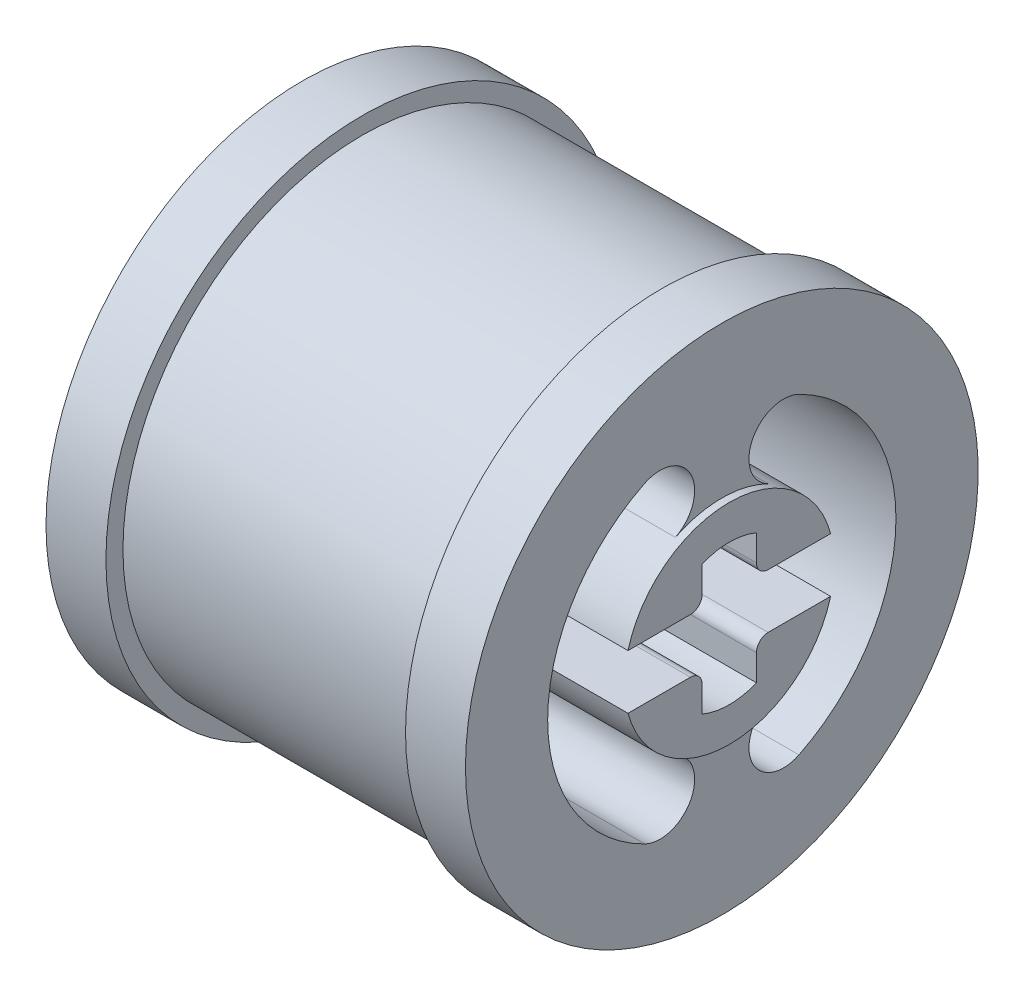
ISO-10303-21;
HEADER;
FILE_DESCRIPTION(('STEP AP214'),'2;1');
FILE_NAME('part.step','',(''),(''),'','','');
FILE_SCHEMA(('AUTOMOTIVE_DESIGN { 1 0 10303 214 1 1 1 1 }'));
ENDSEC;
DATA;
#1=APPLICATION_CONTEXT('core data for automotive mechanical design processes');
#2=APPLICATION_PROTOCOL_DEFINITION('international standard','automotive_design',2000,#1);
#3=PRODUCT_CONTEXT('',#1,'mechanical');
#4=PRODUCT('Part','Part','',(#3));
#5=PRODUCT_RELATED_PRODUCT_CATEGORY('part','',(#4));
#6=PRODUCT_DEFINITION_FORMATION('','',#4);
#7=PRODUCT_DEFINITION_CONTEXT('part definition',#1,'design');
#8=PRODUCT_DEFINITION('design','',#6,#7);
#9=PRODUCT_DEFINITION_SHAPE('','',#8);
#10=(LENGTH_UNIT() NAMED_UNIT(*) SI_UNIT(.MILLI.,.METRE.));
#11=(NAMED_UNIT(*) PLANE_ANGLE_UNIT() SI_UNIT($,.RADIAN.));
#12=(NAMED_UNIT(*) SI_UNIT($,.STERADIAN.) SOLID_ANGLE_UNIT());
#13=UNCERTAINTY_MEASURE_WITH_UNIT(LENGTH_MEASURE(1.E-05),#10,'distance_accuracy_value','');
#14=(GEOMETRIC_REPRESENTATION_CONTEXT(3) GLOBAL_UNCERTAINTY_ASSIGNED_CONTEXT((#13)) GLOBAL_UNIT_ASSIGNED_CONTEXT((#10,
#11,#12)) REPRESENTATION_CONTEXT('',''));
#15=CARTESIAN_POINT('',(0.,0.,0.));
#16=DIRECTION('',(0.,0.,1.));
#17=DIRECTION('',(1.,0.,0.));
#18=AXIS2_PLACEMENT_3D('',#15,#16,#17);
#19=CARTESIAN_POINT('',(7.366,0.,0.));
#20=DIRECTION('',(-1.,0.,0.));
#21=DIRECTION('',(0.,0.,1.));
#22=AXIS2_PLACEMENT_3D('',#19,#20,#21);
#23=CYLINDRICAL_SURFACE('',#22,3.556);
#24=CARTESIAN_POINT('',(-7.112,0.,0.));
#25=DIRECTION('',(-1.,0.,0.));
#26=DIRECTION('',(0.,0.,1.));
#27=AXIS2_PLACEMENT_3D('',#24,#25,#26);
#28=CIRCLE('',#27,3.556);
#29=CARTESIAN_POINT('',(-7.112,-3.18811339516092,1.57514093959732));
#30=VERTEX_POINT('',#29);
#31=CARTESIAN_POINT('',(-7.112,-3.18811339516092,-1.57514093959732));
#32=VERTEX_POINT('',#31);
#33=EDGE_CURVE('E277',#30,#32,#28,.F.);
#34=ORIENTED_EDGE('',*,*,#33,.F.);
#35=DIRECTION('',(1.,0.,0.));
#36=VECTOR('',#35,1.);
#37=CARTESIAN_POINT('',(0.,-3.18811339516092,1.57514093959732));
#38=LINE('',#37,#36);
#39=CARTESIAN_POINT('',(7.112,-3.18811339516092,1.57514093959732));
#40=VERTEX_POINT('',#39);
#41=EDGE_CURVE('E360',#30,#40,#38,.T.);
#42=ORIENTED_EDGE('',*,*,#41,.T.);
#43=CARTESIAN_POINT('',(7.112,0.,0.));
#44=DIRECTION('',(-1.,0.,0.));
#45=DIRECTION('',(0.,0.,1.));
#46=AXIS2_PLACEMENT_3D('',#43,#44,#45);
#47=CIRCLE('',#46,3.556);
#48=CARTESIAN_POINT('',(7.112,-3.18811339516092,-1.57514093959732));
#49=VERTEX_POINT('',#48);
#50=EDGE_CURVE('E377',#40,#49,#47,.F.);
#51=ORIENTED_EDGE('',*,*,#50,.T.);
#52=DIRECTION('',(1.,0.,0.));
#53=VECTOR('',#52,1.);
#54=CARTESIAN_POINT('',(0.,-3.18811339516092,-1.57514093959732));
#55=LINE('',#54,#53);
#56=EDGE_CURVE('E342',#32,#49,#55,.T.);
#57=ORIENTED_EDGE('',*,*,#56,.F.);
#58=EDGE_LOOP('',(#34,#42,#51,#57));
#59=FACE_BOUND('',#58,.T.);
#60=DIRECTION('',(1.,0.,0.));
#61=VECTOR('',#60,1.);
#62=CARTESIAN_POINT('',(0.,-0.92075,-3.43472785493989));
#63=LINE('',#62,#61);
#64=CARTESIAN_POINT('',(-7.366,-0.92075,-3.43472785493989));
#65=VERTEX_POINT('',#64);
#66=CARTESIAN_POINT('',(7.366,-0.92075,-3.43472785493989));
#67=VERTEX_POINT('',#66);
#68=EDGE_CURVE('E312',#65,#67,#63,.T.);
#69=ORIENTED_EDGE('',*,*,#68,.T.);
#70=CARTESIAN_POINT('',(7.366,0.,0.));
#71=DIRECTION('',(1.,0.,0.));
#72=DIRECTION('',(0.,0.,-1.));
#73=AXIS2_PLACEMENT_3D('',#70,#71,#72);
#74=CIRCLE('',#73,3.556);
#75=CARTESIAN_POINT('',(7.366,-0.920749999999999,3.43472785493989));
#76=VERTEX_POINT('',#75);
#77=EDGE_CURVE('E356',#76,#67,#74,.T.);
#78=ORIENTED_EDGE('',*,*,#77,.F.);
#79=DIRECTION('',(1.,0.,0.));
#80=VECTOR('',#79,1.);
#81=CARTESIAN_POINT('',(0.,-0.920749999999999,3.43472785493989));
#82=LINE('',#81,#80);
#83=CARTESIAN_POINT('',(-7.366,-0.920749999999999,3.43472785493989));
#84=VERTEX_POINT('',#83);
#85=EDGE_CURVE('E322',#84,#76,#82,.T.);
#86=ORIENTED_EDGE('',*,*,#85,.F.);
#87=CARTESIAN_POINT('',(-7.366,0.,0.));
#88=DIRECTION('',(1.,0.,0.));
#89=DIRECTION('',(0.,0.,-1.));
#90=AXIS2_PLACEMENT_3D('',#87,#88,#89);
#91=CIRCLE('',#90,3.556);
#92=EDGE_CURVE('E263',#84,#65,#91,.T.);
#93=ORIENTED_EDGE('',*,*,#92,.T.);
#94=EDGE_LOOP('',(#69,#78,#86,#93));
#95=FACE_BOUND('',#94,.T.);
#96=ADVANCED_FACE('F34',(#59,#95),#23,.T.);
#97=CARTESIAN_POINT('',(-7.366,0.92075,-3.43472785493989));
#98=VERTEX_POINT('',#97);
#99=CARTESIAN_POINT('',(-7.366,0.92075,3.43472785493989));
#100=VERTEX_POINT('',#99);
#101=EDGE_CURVE('E264',#98,#100,#91,.T.);
#102=ORIENTED_EDGE('',*,*,#101,.T.);
#103=DIRECTION('',(1.,0.,0.));
#104=VECTOR('',#103,1.);
#105=CARTESIAN_POINT('',(0.,0.92075,3.43472785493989));
#106=LINE('',#105,#104);
#107=CARTESIAN_POINT('',(7.366,0.92075,3.43472785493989));
#108=VERTEX_POINT('',#107);
#109=EDGE_CURVE('E324',#100,#108,#106,.T.);
#110=ORIENTED_EDGE('',*,*,#109,.T.);
#111=CARTESIAN_POINT('',(7.366,0.92075,-3.43472785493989));
#112=VERTEX_POINT('',#111);
#113=EDGE_CURVE('E364',#112,#108,#74,.T.);
#114=ORIENTED_EDGE('',*,*,#113,.F.);
#115=DIRECTION('',(1.,0.,0.));
#116=VECTOR('',#115,1.);
#117=CARTESIAN_POINT('',(0.,0.92075,-3.43472785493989));
#118=LINE('',#117,#116);
#119=EDGE_CURVE('E206',#98,#112,#118,.T.);
#120=ORIENTED_EDGE('',*,*,#119,.F.);
#121=EDGE_LOOP('',(#102,#110,#114,#120));
#122=FACE_BOUND('',#121,.T.);
#123=DIRECTION('',(1.,0.,0.));
#124=VECTOR('',#123,1.);
#125=CARTESIAN_POINT('',(0.,3.18811339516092,1.57514093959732));
#126=LINE('',#125,#124);
#127=CARTESIAN_POINT('',(-7.112,3.18811339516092,1.57514093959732));
#128=VERTEX_POINT('',#127);
#129=CARTESIAN_POINT('',(7.112,3.18811339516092,1.57514093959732));
#130=VERTEX_POINT('',#129);
#131=EDGE_CURVE('E357',#128,#130,#126,.T.);
#132=ORIENTED_EDGE('',*,*,#131,.F.);
#133=CARTESIAN_POINT('',(-7.112,3.18811339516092,-1.57514093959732));
#134=VERTEX_POINT('',#133);
#135=EDGE_CURVE('E276',#134,#128,#28,.F.);
#136=ORIENTED_EDGE('',*,*,#135,.F.);
#137=DIRECTION('',(1.,0.,0.));
#138=VECTOR('',#137,1.);
#139=CARTESIAN_POINT('',(0.,3.18811339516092,-1.57514093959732));
#140=LINE('',#139,#138);
#141=CARTESIAN_POINT('',(7.112,3.18811339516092,-1.57514093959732));
#142=VERTEX_POINT('',#141);
#143=EDGE_CURVE('E336',#134,#142,#140,.T.);
#144=ORIENTED_EDGE('',*,*,#143,.T.);
#145=EDGE_CURVE('E376',#142,#130,#47,.F.);
#146=ORIENTED_EDGE('',*,*,#145,.T.);
#147=EDGE_LOOP('',(#132,#136,#144,#146));
#148=FACE_BOUND('',#147,.T.);
#149=ADVANCED_FACE('F444',(#122,#148),#23,.T.);
#150=CARTESIAN_POINT('',(7.366,0.,0.));
#151=DIRECTION('',(1.,0.,0.));
#152=DIRECTION('',(0.,0.,-1.));
#153=AXIS2_PLACEMENT_3D('',#150,#151,#152);
#154=PLANE('',#153);
#155=DIRECTION('',(0.,-1.,0.));
#156=VECTOR('',#155,1.);
#157=CARTESIAN_POINT('',(7.366,-0.92075,0.92075));
#158=LINE('',#157,#156);
#159=CARTESIAN_POINT('',(7.366,-1.317625,0.92075));
#160=VERTEX_POINT('',#159);
#161=CARTESIAN_POINT('',(7.366,-2.20291924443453,0.92075));
#162=VERTEX_POINT('',#161);
#163=EDGE_CURVE('E303',#160,#162,#158,.T.);
#164=ORIENTED_EDGE('',*,*,#163,.F.);
#165=CARTESIAN_POINT('',(7.366,-1.317625,1.317625));
#166=DIRECTION('',(1.,0.,0.));
#167=DIRECTION('',(0.,0.,-1.));
#168=AXIS2_PLACEMENT_3D('',#165,#166,#167);
#169=CIRCLE('',#168,0.396875);
#170=CARTESIAN_POINT('',(7.366,-0.92075,1.317625));
#171=VERTEX_POINT('',#170);
#172=EDGE_CURVE('E49',#160,#171,#169,.T.);
#173=ORIENTED_EDGE('',*,*,#172,.T.);
#174=DIRECTION('',(0.,0.,-1.));
#175=VECTOR('',#174,1.);
#176=CARTESIAN_POINT('',(7.366,-0.92075,3.43472785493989));
#177=LINE('',#176,#175);
#178=EDGE_CURVE('E301',#76,#171,#177,.T.);
#179=ORIENTED_EDGE('',*,*,#178,.F.);
#180=ORIENTED_EDGE('',*,*,#77,.T.);
#181=DIRECTION('',(0.,0.,1.));
#182=VECTOR('',#181,1.);
#183=CARTESIAN_POINT('',(7.366,-0.92075,-3.43472785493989));
#184=LINE('',#183,#182);
#185=CARTESIAN_POINT('',(7.366,-0.92075,-1.317625));
#186=VERTEX_POINT('',#185);
#187=EDGE_CURVE('E310',#67,#186,#184,.T.);
#188=ORIENTED_EDGE('',*,*,#187,.T.);
#189=CARTESIAN_POINT('',(7.366,-1.317625,-1.317625));
#190=DIRECTION('',(1.,0.,0.));
#191=DIRECTION('',(0.,0.,-1.));
#192=AXIS2_PLACEMENT_3D('',#189,#190,#191);
#193=CIRCLE('',#192,0.396875);
#194=CARTESIAN_POINT('',(7.366,-1.317625,-0.92075));
#195=VERTEX_POINT('',#194);
#196=EDGE_CURVE('E56',#186,#195,#193,.T.);
#197=ORIENTED_EDGE('',*,*,#196,.T.);
#198=DIRECTION('',(0.,-1.,0.));
#199=VECTOR('',#198,1.);
#200=CARTESIAN_POINT('',(7.366,-0.92075,-0.92075));
#201=LINE('',#200,#199);
#202=CARTESIAN_POINT('',(7.366,-2.20291924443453,-0.92075));
#203=VERTEX_POINT('',#202);
#204=EDGE_CURVE('E308',#195,#203,#201,.T.);
#205=ORIENTED_EDGE('',*,*,#204,.T.);
#206=CARTESIAN_POINT('',(7.366,0.,0.));
#207=DIRECTION('',(-1.,0.,0.));
#208=DIRECTION('',(0.,0.,1.));
#209=AXIS2_PLACEMENT_3D('',#206,#207,#208);
#210=CIRCLE('',#209,2.3876);
#211=EDGE_CURVE('E305',#203,#162,#210,.T.);
#212=ORIENTED_EDGE('',*,*,#211,.T.);
#213=EDGE_LOOP('',(#164,#173,#179,#180,#188,#197,#205,#212));
#214=FACE_BOUND('',#213,.T.);
#215=ADVANCED_FACE('F406',(#214),#154,.T.);
#216=DIRECTION('',(0.,1.,0.));
#217=VECTOR('',#216,1.);
#218=CARTESIAN_POINT('',(7.366,0.92075,-0.92075));
#219=LINE('',#218,#217);
#220=CARTESIAN_POINT('',(7.366,1.317625,-0.92075));
#221=VERTEX_POINT('',#220);
#222=CARTESIAN_POINT('',(7.366,2.20291924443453,-0.92075));
#223=VERTEX_POINT('',#222);
#224=EDGE_CURVE('E201',#221,#223,#219,.T.);
#225=ORIENTED_EDGE('',*,*,#224,.F.);
#226=CARTESIAN_POINT('',(7.366,1.317625,-1.317625));
#227=DIRECTION('',(1.,0.,0.));
#228=DIRECTION('',(0.,0.,-1.));
#229=AXIS2_PLACEMENT_3D('',#226,#227,#228);
#230=CIRCLE('',#229,0.396875);
#231=CARTESIAN_POINT('',(7.366,0.92075,-1.317625));
#232=VERTEX_POINT('',#231);
#233=EDGE_CURVE('E384',#221,#232,#230,.T.);
#234=ORIENTED_EDGE('',*,*,#233,.T.);
#235=DIRECTION('',(0.,0.,1.));
#236=VECTOR('',#235,1.);
#237=CARTESIAN_POINT('',(7.366,0.92075,-3.43472785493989));
#238=LINE('',#237,#236);
#239=EDGE_CURVE('E290',#112,#232,#238,.T.);
#240=ORIENTED_EDGE('',*,*,#239,.F.);
#241=ORIENTED_EDGE('',*,*,#113,.T.);
#242=DIRECTION('',(0.,0.,-1.));
#243=VECTOR('',#242,1.);
#244=CARTESIAN_POINT('',(7.366,0.92075,3.43472785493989));
#245=LINE('',#244,#243);
#246=CARTESIAN_POINT('',(7.366,0.92075,1.317625));
#247=VERTEX_POINT('',#246);
#248=EDGE_CURVE('E298',#108,#247,#245,.T.);
#249=ORIENTED_EDGE('',*,*,#248,.T.);
#250=CARTESIAN_POINT('',(7.366,1.317625,1.317625));
#251=DIRECTION('',(1.,0.,0.));
#252=DIRECTION('',(0.,0.,-1.));
#253=AXIS2_PLACEMENT_3D('',#250,#251,#252);
#254=CIRCLE('',#253,0.396875);
#255=CARTESIAN_POINT('',(7.366,1.317625,0.92075));
#256=VERTEX_POINT('',#255);
#257=EDGE_CURVE('E382',#247,#256,#254,.T.);
#258=ORIENTED_EDGE('',*,*,#257,.T.);
#259=DIRECTION('',(0.,1.,0.));
#260=VECTOR('',#259,1.);
#261=CARTESIAN_POINT('',(7.366,0.92075,0.92075));
#262=LINE('',#261,#260);
#263=CARTESIAN_POINT('',(7.366,2.20291924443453,0.92075));
#264=VERTEX_POINT('',#263);
#265=EDGE_CURVE('E296',#256,#264,#262,.T.);
#266=ORIENTED_EDGE('',*,*,#265,.T.);
#267=CARTESIAN_POINT('',(7.366,0.,0.));
#268=DIRECTION('',(1.,0.,0.));
#269=DIRECTION('',(0.,0.,-1.));
#270=AXIS2_PLACEMENT_3D('',#267,#268,#269);
#271=CIRCLE('',#270,2.3876);
#272=EDGE_CURVE('E294',#223,#264,#271,.T.);
#273=ORIENTED_EDGE('',*,*,#272,.F.);
#274=EDGE_LOOP('',(#225,#234,#240,#241,#249,#258,#266,#273));
#275=FACE_BOUND('',#274,.T.);
#276=ADVANCED_FACE('F470',(#275),#154,.T.);
#277=CARTESIAN_POINT('',(7.112,0.,0.));
#278=DIRECTION('',(-1.,0.,0.));
#279=DIRECTION('',(0.,0.,1.));
#280=AXIS2_PLACEMENT_3D('',#277,#278,#279);
#281=PLANE('',#280);
#282=CARTESIAN_POINT('',(7.112,0.,0.));
#283=DIRECTION('',(-1.,0.,0.));
#284=DIRECTION('',(0.,0.,1.));
#285=AXIS2_PLACEMENT_3D('',#282,#283,#284);
#286=CIRCLE('',#285,8.69315);
#287=CARTESIAN_POINT('',(7.112,0.,8.69315));
#288=VERTEX_POINT('',#287);
#289=EDGE_CURVE('E373',#288,#288,#286,.T.);
#290=ORIENTED_EDGE('',*,*,#289,.F.);
#291=EDGE_LOOP('',(#290));
#292=FACE_BOUND('',#291,.T.);
#293=ORIENTED_EDGE('',*,*,#145,.F.);
#294=CARTESIAN_POINT('',(7.112,4.24132942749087,-2.0955));
#295=DIRECTION('',(1.,0.,0.));
#296=DIRECTION('',(0.,0.,-1.));
#297=AXIS2_PLACEMENT_3D('',#294,#295,#296);
#298=CIRCLE('',#297,1.17475);
#299=CARTESIAN_POINT('',(7.112,5.29454545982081,-2.61585906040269));
#300=VERTEX_POINT('',#299);
#301=EDGE_CURVE('E315',#300,#142,#298,.T.);
#302=ORIENTED_EDGE('',*,*,#301,.F.);
#303=CARTESIAN_POINT('',(7.112,0.,0.));
#304=DIRECTION('',(1.,0.,0.));
#305=DIRECTION('',(0.,0.,-1.));
#306=AXIS2_PLACEMENT_3D('',#303,#304,#305);
#307=CIRCLE('',#306,5.9055);
#308=CARTESIAN_POINT('',(7.112,-5.29454545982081,-2.61585906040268));
#309=VERTEX_POINT('',#308);
#310=EDGE_CURVE('E333',#309,#300,#307,.T.);
#311=ORIENTED_EDGE('',*,*,#310,.F.);
#312=CARTESIAN_POINT('',(7.112,-4.24132942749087,-2.0955));
#313=DIRECTION('',(-1.,0.,0.));
#314=DIRECTION('',(0.,0.,1.));
#315=AXIS2_PLACEMENT_3D('',#312,#313,#314);
#316=CIRCLE('',#315,1.17475);
#317=EDGE_CURVE('E330',#309,#49,#316,.T.);
#318=ORIENTED_EDGE('',*,*,#317,.T.);
#319=ORIENTED_EDGE('',*,*,#50,.F.);
#320=CARTESIAN_POINT('',(7.112,-4.24132942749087,2.0955));
#321=DIRECTION('',(1.,0.,0.));
#322=DIRECTION('',(0.,0.,-1.));
#323=AXIS2_PLACEMENT_3D('',#320,#321,#322);
#324=CIRCLE('',#323,1.17475);
#325=CARTESIAN_POINT('',(7.112,-5.29454545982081,2.61585906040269));
#326=VERTEX_POINT('',#325);
#327=EDGE_CURVE('E348',#326,#40,#324,.T.);
#328=ORIENTED_EDGE('',*,*,#327,.F.);
#329=CARTESIAN_POINT('',(7.112,0.,0.));
#330=DIRECTION('',(1.,0.,0.));
#331=DIRECTION('',(0.,0.,-1.));
#332=AXIS2_PLACEMENT_3D('',#329,#330,#331);
#333=CIRCLE('',#332,5.9055);
#334=CARTESIAN_POINT('',(7.112,5.29454545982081,2.61585906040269));
#335=VERTEX_POINT('',#334);
#336=EDGE_CURVE('E339',#335,#326,#333,.T.);
#337=ORIENTED_EDGE('',*,*,#336,.F.);
#338=CARTESIAN_POINT('',(7.112,4.24132942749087,2.0955));
#339=DIRECTION('',(-1.,0.,0.));
#340=DIRECTION('',(0.,0.,1.));
#341=AXIS2_PLACEMENT_3D('',#338,#339,#340);
#342=CIRCLE('',#341,1.17475);
#343=EDGE_CURVE('E350',#335,#130,#342,.T.);
#344=ORIENTED_EDGE('',*,*,#343,.T.);
#345=EDGE_LOOP('',(#293,#302,#311,#318,#319,#328,#337,#344));
#346=FACE_BOUND('',#345,.T.);
#347=ADVANCED_FACE('F467',(#292,#346),#281,.F.);
#348=CARTESIAN_POINT('',(0.,0.,0.));
#349=DIRECTION('',(-1.,0.,0.));
#350=DIRECTION('',(0.,0.,1.));
#351=AXIS2_PLACEMENT_3D('',#348,#349,#350);
#352=CYLINDRICAL_SURFACE('',#351,8.69315);
#353=ORIENTED_EDGE('',*,*,#289,.T.);
#354=EDGE_LOOP('',(#353));
#355=FACE_BOUND('',#354,.T.);
#356=CARTESIAN_POINT('',(5.08,0.,0.));
#357=DIRECTION('',(-1.,0.,0.));
#358=DIRECTION('',(0.,0.,1.));
#359=AXIS2_PLACEMENT_3D('',#356,#357,#358);
#360=CIRCLE('',#359,8.69315);
#361=CARTESIAN_POINT('',(5.08,0.,8.69315));
#362=VERTEX_POINT('',#361);
#363=EDGE_CURVE('E370',#362,#362,#360,.T.);
#364=ORIENTED_EDGE('',*,*,#363,.F.);
#365=EDGE_LOOP('',(#364));
#366=FACE_BOUND('',#365,.T.);
#367=ADVANCED_FACE('F463',(#355,#366),#352,.T.);
#368=CARTESIAN_POINT('',(5.08,8.1153,0.));
#369=DIRECTION('',(-1.,0.,0.));
#370=DIRECTION('',(0.,0.,1.));
#371=AXIS2_PLACEMENT_3D('',#368,#369,#370);
#372=PLANE('',#371);
#373=ORIENTED_EDGE('',*,*,#363,.T.);
#374=EDGE_LOOP('',(#373));
#375=FACE_BOUND('',#374,.T.);
#376=CARTESIAN_POINT('',(5.08,0.,0.));
#377=DIRECTION('',(-1.,0.,0.));
#378=DIRECTION('',(0.,0.,1.));
#379=AXIS2_PLACEMENT_3D('',#376,#377,#378);
#380=CIRCLE('',#379,8.1153);
#381=CARTESIAN_POINT('',(5.08,0.,8.1153));
#382=VERTEX_POINT('',#381);
#383=EDGE_CURVE('E367',#382,#382,#380,.T.);
#384=ORIENTED_EDGE('',*,*,#383,.F.);
#385=EDGE_LOOP('',(#384));
#386=FACE_BOUND('',#385,.T.);
#387=ADVANCED_FACE('F459',(#375,#386),#372,.T.);
#388=CARTESIAN_POINT('',(0.,0.,0.));
#389=DIRECTION('',(-1.,0.,0.));
#390=DIRECTION('',(0.,0.,1.));
#391=AXIS2_PLACEMENT_3D('',#388,#389,#390);
#392=CYLINDRICAL_SURFACE('',#391,8.1153);
#393=ORIENTED_EDGE('',*,*,#383,.T.);
#394=EDGE_LOOP('',(#393));
#395=FACE_BOUND('',#394,.T.);
#396=CARTESIAN_POINT('',(-5.08,0.,0.));
#397=DIRECTION('',(-1.,0.,0.));
#398=DIRECTION('',(0.,0.,1.));
#399=AXIS2_PLACEMENT_3D('',#396,#397,#398);
#400=CIRCLE('',#399,8.1153);
#401=CARTESIAN_POINT('',(-5.08,0.,8.1153));
#402=VERTEX_POINT('',#401);
#403=EDGE_CURVE('E267',#402,#402,#400,.T.);
#404=ORIENTED_EDGE('',*,*,#403,.F.);
#405=EDGE_LOOP('',(#404));
#406=FACE_BOUND('',#405,.T.);
#407=ADVANCED_FACE('F455',(#395,#406),#392,.T.);
#408=CARTESIAN_POINT('',(0.,0.,0.));
#409=DIRECTION('',(1.,0.,0.));
#410=DIRECTION('',(0.,0.,-1.));
#411=AXIS2_PLACEMENT_3D('',#408,#409,#410);
#412=CYLINDRICAL_SURFACE('',#411,5.9055);
#413=ORIENTED_EDGE('',*,*,#336,.T.);
#414=DIRECTION('',(1.,0.,0.));
#415=VECTOR('',#414,1.);
#416=CARTESIAN_POINT('',(0.,-5.29454545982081,2.61585906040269));
#417=LINE('',#416,#415);
#418=CARTESIAN_POINT('',(-7.112,-5.29454545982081,2.61585906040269));
#419=VERTEX_POINT('',#418);
#420=EDGE_CURVE('E353',#419,#326,#417,.T.);
#421=ORIENTED_EDGE('',*,*,#420,.F.);
#422=CARTESIAN_POINT('',(-7.112,0.,0.));
#423=DIRECTION('',(1.,0.,0.));
#424=DIRECTION('',(0.,0.,-1.));
#425=AXIS2_PLACEMENT_3D('',#422,#423,#424);
#426=CIRCLE('',#425,5.9055);
#427=CARTESIAN_POINT('',(-7.112,5.29454545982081,2.61585906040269));
#428=VERTEX_POINT('',#427);
#429=EDGE_CURVE('E254',#428,#419,#426,.T.);
#430=ORIENTED_EDGE('',*,*,#429,.F.);
#431=DIRECTION('',(1.,0.,0.));
#432=VECTOR('',#431,1.);
#433=CARTESIAN_POINT('',(0.,5.29454545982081,2.61585906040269));
#434=LINE('',#433,#432);
#435=EDGE_CURVE('E354',#428,#335,#434,.T.);
#436=ORIENTED_EDGE('',*,*,#435,.T.);
#437=EDGE_LOOP('',(#413,#421,#430,#436));
#438=FACE_BOUND('',#437,.T.);
#439=ADVANCED_FACE('F458',(#438),#412,.F.);
#440=CARTESIAN_POINT('',(0.,4.24132942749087,2.0955));
#441=DIRECTION('',(1.,0.,0.));
#442=DIRECTION('',(0.,0.,-1.));
#443=AXIS2_PLACEMENT_3D('',#440,#441,#442);
#444=CYLINDRICAL_SURFACE('',#443,1.17475);
#445=ORIENTED_EDGE('',*,*,#343,.F.);
#446=ORIENTED_EDGE('',*,*,#435,.F.);
#447=CARTESIAN_POINT('',(-7.112,4.24132942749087,2.0955));
#448=DIRECTION('',(-1.,0.,0.));
#449=DIRECTION('',(0.,0.,1.));
#450=AXIS2_PLACEMENT_3D('',#447,#448,#449);
#451=CIRCLE('',#450,1.17475);
#452=EDGE_CURVE('E260',#428,#128,#451,.T.);
#453=ORIENTED_EDGE('',*,*,#452,.T.);
#454=ORIENTED_EDGE('',*,*,#131,.T.);
#455=EDGE_LOOP('',(#445,#446,#453,#454));
#456=FACE_BOUND('',#455,.T.);
#457=ADVANCED_FACE('F705',(#456),#444,.F.);
#458=CARTESIAN_POINT('',(0.,-4.24132942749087,2.0955));
#459=DIRECTION('',(1.,0.,0.));
#460=DIRECTION('',(0.,0.,-1.));
#461=AXIS2_PLACEMENT_3D('',#458,#459,#460);
#462=CYLINDRICAL_SURFACE('',#461,1.17475);
#463=ORIENTED_EDGE('',*,*,#327,.T.);
#464=ORIENTED_EDGE('',*,*,#41,.F.);
#465=CARTESIAN_POINT('',(-7.112,-4.24132942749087,2.0955));
#466=DIRECTION('',(1.,0.,0.));
#467=DIRECTION('',(0.,0.,-1.));
#468=AXIS2_PLACEMENT_3D('',#465,#466,#467);
#469=CIRCLE('',#468,1.17475);
#470=EDGE_CURVE('E257',#419,#30,#469,.T.);
#471=ORIENTED_EDGE('',*,*,#470,.F.);
#472=ORIENTED_EDGE('',*,*,#420,.T.);
#473=EDGE_LOOP('',(#463,#464,#471,#472));
#474=FACE_BOUND('',#473,.T.);
#475=ADVANCED_FACE('F694',(#474),#462,.F.);
#476=CARTESIAN_POINT('',(0.,4.24132942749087,-2.0955));
#477=DIRECTION('',(1.,0.,0.));
#478=DIRECTION('',(0.,0.,-1.));
#479=AXIS2_PLACEMENT_3D('',#476,#477,#478);
#480=CYLINDRICAL_SURFACE('',#479,1.17475);
#481=ORIENTED_EDGE('',*,*,#301,.T.);
#482=ORIENTED_EDGE('',*,*,#143,.F.);
#483=CARTESIAN_POINT('',(-7.112,4.24132942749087,-2.0955));
#484=DIRECTION('',(1.,0.,0.));
#485=DIRECTION('',(0.,0.,-1.));
#486=AXIS2_PLACEMENT_3D('',#483,#484,#485);
#487=CIRCLE('',#486,1.17475);
#488=CARTESIAN_POINT('',(-7.112,5.29454545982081,-2.61585906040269));
#489=VERTEX_POINT('',#488);
#490=EDGE_CURVE('E245',#489,#134,#487,.T.);
#491=ORIENTED_EDGE('',*,*,#490,.F.);
#492=DIRECTION('',(1.,0.,0.));
#493=VECTOR('',#492,1.);
#494=CARTESIAN_POINT('',(0.,5.29454545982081,-2.61585906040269));
#495=LINE('',#494,#493);
#496=EDGE_CURVE('E337',#489,#300,#495,.T.);
#497=ORIENTED_EDGE('',*,*,#496,.T.);
#498=EDGE_LOOP('',(#481,#482,#491,#497));
#499=FACE_BOUND('',#498,.T.);
#500=ADVANCED_FACE('F683',(#499),#480,.F.);
#501=CARTESIAN_POINT('',(0.,0.,0.));
#502=DIRECTION('',(1.,0.,0.));
#503=DIRECTION('',(0.,0.,-1.));
#504=AXIS2_PLACEMENT_3D('',#501,#502,#503);
#505=CYLINDRICAL_SURFACE('',#504,5.9055);
#506=ORIENTED_EDGE('',*,*,#310,.T.);
#507=ORIENTED_EDGE('',*,*,#496,.F.);
#508=CARTESIAN_POINT('',(-7.112,0.,0.));
#509=DIRECTION('',(1.,0.,0.));
#510=DIRECTION('',(0.,0.,-1.));
#511=AXIS2_PLACEMENT_3D('',#508,#509,#510);
#512=CIRCLE('',#511,5.9055);
#513=CARTESIAN_POINT('',(-7.112,-5.29454545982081,-2.61585906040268));
#514=VERTEX_POINT('',#513);
#515=EDGE_CURVE('E251',#514,#489,#512,.T.);
#516=ORIENTED_EDGE('',*,*,#515,.F.);
#517=DIRECTION('',(1.,0.,0.));
#518=VECTOR('',#517,1.);
#519=CARTESIAN_POINT('',(0.,-5.29454545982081,-2.61585906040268));
#520=LINE('',#519,#518);
#521=EDGE_CURVE('E340',#514,#309,#520,.T.);
#522=ORIENTED_EDGE('',*,*,#521,.T.);
#523=EDGE_LOOP('',(#506,#507,#516,#522));
#524=FACE_BOUND('',#523,.T.);
#525=ADVANCED_FACE('F672',(#524),#505,.F.);
#526=CARTESIAN_POINT('',(0.,-4.24132942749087,-2.0955));
#527=DIRECTION('',(1.,0.,0.));
#528=DIRECTION('',(0.,0.,-1.));
#529=AXIS2_PLACEMENT_3D('',#526,#527,#528);
#530=CYLINDRICAL_SURFACE('',#529,1.17475);
#531=ORIENTED_EDGE('',*,*,#317,.F.);
#532=ORIENTED_EDGE('',*,*,#521,.F.);
#533=CARTESIAN_POINT('',(-7.112,-4.24132942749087,-2.0955));
#534=DIRECTION('',(-1.,0.,0.));
#535=DIRECTION('',(0.,0.,1.));
#536=AXIS2_PLACEMENT_3D('',#533,#534,#535);
#537=CIRCLE('',#536,1.17475);
#538=EDGE_CURVE('E248',#514,#32,#537,.T.);
#539=ORIENTED_EDGE('',*,*,#538,.T.);
#540=ORIENTED_EDGE('',*,*,#56,.T.);
#541=EDGE_LOOP('',(#531,#532,#539,#540));
#542=FACE_BOUND('',#541,.T.);
#543=ADVANCED_FACE('F623',(#542),#530,.F.);
#544=CARTESIAN_POINT('',(0.,0.92075,-3.43472785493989));
#545=DIRECTION('',(0.,1.,0.));
#546=DIRECTION('',(0.,0.,1.));
#547=AXIS2_PLACEMENT_3D('',#544,#545,#546);
#548=PLANE('',#547);
#549=ORIENTED_EDGE('',*,*,#239,.T.);
#550=DIRECTION('',(1.,0.,0.));
#551=VECTOR('',#550,1.);
#552=CARTESIAN_POINT('',(0.,0.92075,-1.317625));
#553=LINE('',#552,#551);
#554=CARTESIAN_POINT('',(-7.366,0.92075,-1.317625));
#555=VERTEX_POINT('',#554);
#556=EDGE_CURVE('E386',#232,#555,#553,.F.);
#557=ORIENTED_EDGE('',*,*,#556,.T.);
#558=DIRECTION('',(0.,0.,1.));
#559=VECTOR('',#558,1.);
#560=CARTESIAN_POINT('',(-7.366,0.92075,-3.43472785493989));
#561=LINE('',#560,#559);
#562=EDGE_CURVE('E222',#98,#555,#561,.T.);
#563=ORIENTED_EDGE('',*,*,#562,.F.);
#564=ORIENTED_EDGE('',*,*,#119,.T.);
#565=EDGE_LOOP('',(#549,#557,#563,#564));
#566=FACE_BOUND('',#565,.T.);
#567=ADVANCED_FACE('F613',(#566),#548,.F.);
#568=CARTESIAN_POINT('',(0.,0.92075,-0.92075));
#569=DIRECTION('',(0.,0.,-1.));
#570=DIRECTION('',(-1.,0.,0.));
#571=AXIS2_PLACEMENT_3D('',#568,#569,#570);
#572=PLANE('',#571);
#573=DIRECTION('',(1.,0.,0.));
#574=VECTOR('',#573,1.);
#575=CARTESIAN_POINT('',(0.,2.20291924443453,-0.92075));
#576=LINE('',#575,#574);
#577=CARTESIAN_POINT('',(-7.366,2.20291924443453,-0.92075));
#578=VERTEX_POINT('',#577);
#579=EDGE_CURVE('E194',#578,#223,#576,.T.);
#580=ORIENTED_EDGE('',*,*,#579,.F.);
#581=DIRECTION('',(0.,1.,0.));
#582=VECTOR('',#581,1.);
#583=CARTESIAN_POINT('',(-7.366,0.92075,-0.92075));
#584=LINE('',#583,#582);
#585=CARTESIAN_POINT('',(-7.366,1.317625,-0.92075));
#586=VERTEX_POINT('',#585);
#587=EDGE_CURVE('E199',#586,#578,#584,.T.);
#588=ORIENTED_EDGE('',*,*,#587,.F.);
#589=DIRECTION('',(1.,0.,0.));
#590=VECTOR('',#589,1.);
#591=CARTESIAN_POINT('',(0.,1.317625,-0.92075));
#592=LINE('',#591,#590);
#593=EDGE_CURVE('E380',#586,#221,#592,.T.);
#594=ORIENTED_EDGE('',*,*,#593,.T.);
#595=ORIENTED_EDGE('',*,*,#224,.T.);
#596=EDGE_LOOP('',(#580,#588,#594,#595));
#597=FACE_BOUND('',#596,.T.);
#598=ADVANCED_FACE('F196',(#597),#572,.F.);
#599=CARTESIAN_POINT('',(0.,0.,0.));
#600=DIRECTION('',(1.,0.,0.));
#601=DIRECTION('',(0.,0.,-1.));
#602=AXIS2_PLACEMENT_3D('',#599,#600,#601);
#603=CYLINDRICAL_SURFACE('',#602,2.3876);
#604=ORIENTED_EDGE('',*,*,#272,.T.);
#605=DIRECTION('',(1.,0.,0.));
#606=VECTOR('',#605,1.);
#607=CARTESIAN_POINT('',(0.,2.20291924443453,0.92075));
#608=LINE('',#607,#606);
#609=CARTESIAN_POINT('',(-7.366,2.20291924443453,0.92075));
#610=VERTEX_POINT('',#609);
#611=EDGE_CURVE('E205',#610,#264,#608,.T.);
#612=ORIENTED_EDGE('',*,*,#611,.F.);
#613=CARTESIAN_POINT('',(-7.366,0.,0.));
#614=DIRECTION('',(1.,0.,0.));
#615=DIRECTION('',(0.,0.,-1.));
#616=AXIS2_PLACEMENT_3D('',#613,#614,#615);
#617=CIRCLE('',#616,2.3876);
#618=EDGE_CURVE('E209',#578,#610,#617,.T.);
#619=ORIENTED_EDGE('',*,*,#618,.F.);
#620=ORIENTED_EDGE('',*,*,#579,.T.);
#621=EDGE_LOOP('',(#604,#612,#619,#620));
#622=FACE_BOUND('',#621,.T.);
#623=ADVANCED_FACE('F210',(#622),#603,.F.);
#624=CARTESIAN_POINT('',(0.,0.92075,0.92075));
#625=DIRECTION('',(0.,0.,-1.));
#626=DIRECTION('',(-1.,0.,0.));
#627=AXIS2_PLACEMENT_3D('',#624,#625,#626);
#628=PLANE('',#627);
#629=ORIENTED_EDGE('',*,*,#265,.F.);
#630=DIRECTION('',(1.,0.,0.));
#631=VECTOR('',#630,1.);
#632=CARTESIAN_POINT('',(0.,1.317625,0.92075));
#633=LINE('',#632,#631);
#634=CARTESIAN_POINT('',(-7.366,1.317625,0.92075));
#635=VERTEX_POINT('',#634);
#636=EDGE_CURVE('E391',#256,#635,#633,.F.);
#637=ORIENTED_EDGE('',*,*,#636,.T.);
#638=DIRECTION('',(0.,1.,0.));
#639=VECTOR('',#638,1.);
#640=CARTESIAN_POINT('',(-7.366,0.92075,0.92075));
#641=LINE('',#640,#639);
#642=EDGE_CURVE('E215',#635,#610,#641,.T.);
#643=ORIENTED_EDGE('',*,*,#642,.T.);
#644=ORIENTED_EDGE('',*,*,#611,.T.);
#645=EDGE_LOOP('',(#629,#637,#643,#644));
#646=FACE_BOUND('',#645,.T.);
#647=ADVANCED_FACE('F591',(#646),#628,.T.);
#648=CARTESIAN_POINT('',(0.,0.92075,3.43472785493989));
#649=DIRECTION('',(0.,-1.,0.));
#650=DIRECTION('',(0.,0.,-1.));
#651=AXIS2_PLACEMENT_3D('',#648,#649,#650);
#652=PLANE('',#651);
#653=ORIENTED_EDGE('',*,*,#109,.F.);
#654=DIRECTION('',(0.,0.,-1.));
#655=VECTOR('',#654,1.);
#656=CARTESIAN_POINT('',(-7.366,0.92075,3.43472785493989));
#657=LINE('',#656,#655);
#658=CARTESIAN_POINT('',(-7.366,0.92075,1.317625));
#659=VERTEX_POINT('',#658);
#660=EDGE_CURVE('E227',#100,#659,#657,.T.);
#661=ORIENTED_EDGE('',*,*,#660,.T.);
#662=DIRECTION('',(1.,0.,0.));
#663=VECTOR('',#662,1.);
#664=CARTESIAN_POINT('',(0.,0.92075,1.317625));
#665=LINE('',#664,#663);
#666=EDGE_CURVE('E388',#659,#247,#665,.T.);
#667=ORIENTED_EDGE('',*,*,#666,.T.);
#668=ORIENTED_EDGE('',*,*,#248,.F.);
#669=EDGE_LOOP('',(#653,#661,#667,#668));
#670=FACE_BOUND('',#669,.T.);
#671=ADVANCED_FACE('F501',(#670),#652,.T.);
#672=CARTESIAN_POINT('',(0.,-0.92075,-3.43472785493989));
#673=DIRECTION('',(0.,1.,0.));
#674=DIRECTION('',(0.,0.,1.));
#675=AXIS2_PLACEMENT_3D('',#672,#673,#674);
#676=PLANE('',#675);
#677=ORIENTED_EDGE('',*,*,#68,.F.);
#678=DIRECTION('',(0.,0.,1.));
#679=VECTOR('',#678,1.);
#680=CARTESIAN_POINT('',(-7.366,-0.92075,-3.43472785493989));
#681=LINE('',#680,#679);
#682=CARTESIAN_POINT('',(-7.366,-0.92075,-1.317625));
#683=VERTEX_POINT('',#682);
#684=EDGE_CURVE('E242',#65,#683,#681,.T.);
#685=ORIENTED_EDGE('',*,*,#684,.T.);
#686=DIRECTION('',(1.,0.,0.));
#687=VECTOR('',#686,1.);
#688=CARTESIAN_POINT('',(0.,-0.92075,-1.317625));
#689=LINE('',#688,#687);
#690=EDGE_CURVE('E42',#683,#186,#689,.T.);
#691=ORIENTED_EDGE('',*,*,#690,.T.);
#692=ORIENTED_EDGE('',*,*,#187,.F.);
#693=EDGE_LOOP('',(#677,#685,#691,#692));
#694=FACE_BOUND('',#693,.T.);
#695=ADVANCED_FACE('F401',(#694),#676,.T.);
#696=CARTESIAN_POINT('',(0.,-0.92075,-0.92075));
#697=DIRECTION('',(0.,0.,1.));
#698=DIRECTION('',(1.,0.,0.));
#699=AXIS2_PLACEMENT_3D('',#696,#697,#698);
#700=PLANE('',#699);
#701=ORIENTED_EDGE('',*,*,#204,.F.);
#702=DIRECTION('',(1.,0.,0.));
#703=VECTOR('',#702,1.);
#704=CARTESIAN_POINT('',(0.,-1.317625,-0.92075));
#705=LINE('',#704,#703);
#706=CARTESIAN_POINT('',(-7.366,-1.317625,-0.92075));
#707=VERTEX_POINT('',#706);
#708=EDGE_CURVE('E11',#195,#707,#705,.F.);
#709=ORIENTED_EDGE('',*,*,#708,.T.);
#710=DIRECTION('',(0.,-1.,0.));
#711=VECTOR('',#710,1.);
#712=CARTESIAN_POINT('',(-7.366,-0.92075,-0.92075));
#713=LINE('',#712,#711);
#714=CARTESIAN_POINT('',(-7.366,-2.20291924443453,-0.92075));
#715=VERTEX_POINT('',#714);
#716=EDGE_CURVE('E239',#707,#715,#713,.T.);
#717=ORIENTED_EDGE('',*,*,#716,.T.);
#718=DIRECTION('',(1.,0.,0.));
#719=VECTOR('',#718,1.);
#720=CARTESIAN_POINT('',(0.,-2.20291924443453,-0.92075));
#721=LINE('',#720,#719);
#722=EDGE_CURVE('E316',#715,#203,#721,.T.);
#723=ORIENTED_EDGE('',*,*,#722,.T.);
#724=EDGE_LOOP('',(#701,#709,#717,#723));
#725=FACE_BOUND('',#724,.T.);
#726=ADVANCED_FACE('F418',(#725),#700,.T.);
#727=CARTESIAN_POINT('',(0.,0.,0.));
#728=DIRECTION('',(1.,0.,0.));
#729=DIRECTION('',(0.,0.,-1.));
#730=AXIS2_PLACEMENT_3D('',#727,#728,#729);
#731=CYLINDRICAL_SURFACE('',#730,2.3876);
#732=ORIENTED_EDGE('',*,*,#211,.F.);
#733=ORIENTED_EDGE('',*,*,#722,.F.);
#734=CARTESIAN_POINT('',(-7.366,0.,0.));
#735=DIRECTION('',(-1.,0.,0.));
#736=DIRECTION('',(0.,0.,1.));
#737=AXIS2_PLACEMENT_3D('',#734,#735,#736);
#738=CIRCLE('',#737,2.3876);
#739=CARTESIAN_POINT('',(-7.366,-2.20291924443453,0.92075));
#740=VERTEX_POINT('',#739);
#741=EDGE_CURVE('E236',#715,#740,#738,.T.);
#742=ORIENTED_EDGE('',*,*,#741,.T.);
#743=DIRECTION('',(1.,0.,0.));
#744=VECTOR('',#743,1.);
#745=CARTESIAN_POINT('',(0.,-2.20291924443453,0.92075));
#746=LINE('',#745,#744);
#747=EDGE_CURVE('E319',#740,#162,#746,.T.);
#748=ORIENTED_EDGE('',*,*,#747,.T.);
#749=EDGE_LOOP('',(#732,#733,#742,#748));
#750=FACE_BOUND('',#749,.T.);
#751=ADVANCED_FACE('F421',(#750),#731,.F.);
#752=CARTESIAN_POINT('',(0.,-0.92075,0.92075));
#753=DIRECTION('',(0.,0.,1.));
#754=DIRECTION('',(1.,0.,0.));
#755=AXIS2_PLACEMENT_3D('',#752,#753,#754);
#756=PLANE('',#755);
#757=ORIENTED_EDGE('',*,*,#747,.F.);
#758=DIRECTION('',(0.,-1.,0.));
#759=VECTOR('',#758,1.);
#760=CARTESIAN_POINT('',(-7.366,-0.92075,0.92075));
#761=LINE('',#760,#759);
#762=CARTESIAN_POINT('',(-7.366,-1.317625,0.92075));
#763=VERTEX_POINT('',#762);
#764=EDGE_CURVE('E233',#763,#740,#761,.T.);
#765=ORIENTED_EDGE('',*,*,#764,.F.);
#766=DIRECTION('',(1.,0.,0.));
#767=VECTOR('',#766,1.);
#768=CARTESIAN_POINT('',(0.,-1.317625,0.92075));
#769=LINE('',#768,#767);
#770=EDGE_CURVE('E393',#763,#160,#769,.T.);
#771=ORIENTED_EDGE('',*,*,#770,.T.);
#772=ORIENTED_EDGE('',*,*,#163,.T.);
#773=EDGE_LOOP('',(#757,#765,#771,#772));
#774=FACE_BOUND('',#773,.T.);
#775=ADVANCED_FACE('F424',(#774),#756,.F.);
#776=CARTESIAN_POINT('',(0.,-0.92075,3.43472785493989));
#777=DIRECTION('',(0.,-1.,0.));
#778=DIRECTION('',(0.,0.,-1.));
#779=AXIS2_PLACEMENT_3D('',#776,#777,#778);
#780=PLANE('',#779);
#781=ORIENTED_EDGE('',*,*,#178,.T.);
#782=DIRECTION('',(1.,0.,0.));
#783=VECTOR('',#782,1.);
#784=CARTESIAN_POINT('',(0.,-0.92075,1.317625));
#785=LINE('',#784,#783);
#786=CARTESIAN_POINT('',(-7.366,-0.92075,1.317625));
#787=VERTEX_POINT('',#786);
#788=EDGE_CURVE('E398',#171,#787,#785,.F.);
#789=ORIENTED_EDGE('',*,*,#788,.T.);
#790=DIRECTION('',(0.,0.,-1.));
#791=VECTOR('',#790,1.);
#792=CARTESIAN_POINT('',(-7.366,-0.92075,3.43472785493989));
#793=LINE('',#792,#791);
#794=EDGE_CURVE('E230',#84,#787,#793,.T.);
#795=ORIENTED_EDGE('',*,*,#794,.F.);
#796=ORIENTED_EDGE('',*,*,#85,.T.);
#797=EDGE_LOOP('',(#781,#789,#795,#796));
#798=FACE_BOUND('',#797,.T.);
#799=ADVANCED_FACE('F430',(#798),#780,.F.);
#800=CARTESIAN_POINT('',(0.,1.317625,-1.317625));
#801=DIRECTION('',(1.,0.,0.));
#802=DIRECTION('',(0.,0.,-1.));
#803=AXIS2_PLACEMENT_3D('',#800,#801,#802);
#804=CYLINDRICAL_SURFACE('',#803,0.396875);
#805=ORIENTED_EDGE('',*,*,#593,.F.);
#806=CARTESIAN_POINT('',(-7.366,1.317625,-1.317625));
#807=DIRECTION('',(1.,0.,0.));
#808=DIRECTION('',(0.,0.,-1.));
#809=AXIS2_PLACEMENT_3D('',#806,#807,#808);
#810=CIRCLE('',#809,0.396875);
#811=EDGE_CURVE('E221',#586,#555,#810,.T.);
#812=ORIENTED_EDGE('',*,*,#811,.T.);
#813=ORIENTED_EDGE('',*,*,#556,.F.);
#814=ORIENTED_EDGE('',*,*,#233,.F.);
#815=EDGE_LOOP('',(#805,#812,#813,#814));
#816=FACE_BOUND('',#815,.T.);
#817=ADVANCED_FACE('F432',(#816),#804,.T.);
#818=CARTESIAN_POINT('',(0.,1.317625,1.317625));
#819=DIRECTION('',(1.,0.,0.));
#820=DIRECTION('',(0.,0.,-1.));
#821=AXIS2_PLACEMENT_3D('',#818,#819,#820);
#822=CYLINDRICAL_SURFACE('',#821,0.396875);
#823=ORIENTED_EDGE('',*,*,#666,.F.);
#824=CARTESIAN_POINT('',(-7.366,1.317625,1.317625));
#825=DIRECTION('',(1.,0.,0.));
#826=DIRECTION('',(0.,0.,-1.));
#827=AXIS2_PLACEMENT_3D('',#824,#825,#826);
#828=CIRCLE('',#827,0.396875);
#829=EDGE_CURVE('E280',#659,#635,#828,.T.);
#830=ORIENTED_EDGE('',*,*,#829,.T.);
#831=ORIENTED_EDGE('',*,*,#636,.F.);
#832=ORIENTED_EDGE('',*,*,#257,.F.);
#833=EDGE_LOOP('',(#823,#830,#831,#832));
#834=FACE_BOUND('',#833,.T.);
#835=ADVANCED_FACE('F438',(#834),#822,.T.);
#836=CARTESIAN_POINT('',(0.,-1.317625,1.317625));
#837=DIRECTION('',(1.,0.,0.));
#838=DIRECTION('',(0.,0.,-1.));
#839=AXIS2_PLACEMENT_3D('',#836,#837,#838);
#840=CYLINDRICAL_SURFACE('',#839,0.396875);
#841=ORIENTED_EDGE('',*,*,#770,.F.);
#842=CARTESIAN_POINT('',(-7.366,-1.317625,1.317625));
#843=DIRECTION('',(1.,0.,0.));
#844=DIRECTION('',(0.,0.,-1.));
#845=AXIS2_PLACEMENT_3D('',#842,#843,#844);
#846=CIRCLE('',#845,0.396875);
#847=EDGE_CURVE('E287',#763,#787,#846,.T.);
#848=ORIENTED_EDGE('',*,*,#847,.T.);
#849=ORIENTED_EDGE('',*,*,#788,.F.);
#850=ORIENTED_EDGE('',*,*,#172,.F.);
#851=EDGE_LOOP('',(#841,#848,#849,#850));
#852=FACE_BOUND('',#851,.T.);
#853=ADVANCED_FACE('F427',(#852),#840,.T.);
#854=CARTESIAN_POINT('',(0.,-1.317625,-1.317625));
#855=DIRECTION('',(1.,0.,0.));
#856=DIRECTION('',(0.,0.,-1.));
#857=AXIS2_PLACEMENT_3D('',#854,#855,#856);
#858=CYLINDRICAL_SURFACE('',#857,0.396875);
#859=ORIENTED_EDGE('',*,*,#690,.F.);
#860=CARTESIAN_POINT('',(-7.366,-1.317625,-1.317625));
#861=DIRECTION('',(1.,0.,0.));
#862=DIRECTION('',(0.,0.,-1.));
#863=AXIS2_PLACEMENT_3D('',#860,#861,#862);
#864=CIRCLE('',#863,0.396875);
#865=EDGE_CURVE('E284',#683,#707,#864,.T.);
#866=ORIENTED_EDGE('',*,*,#865,.T.);
#867=ORIENTED_EDGE('',*,*,#708,.F.);
#868=ORIENTED_EDGE('',*,*,#196,.F.);
#869=EDGE_LOOP('',(#859,#866,#867,#868));
#870=FACE_BOUND('',#869,.T.);
#871=ADVANCED_FACE('F36',(#870),#858,.T.);
#872=CARTESIAN_POINT('',(-7.366,0.,0.));
#873=DIRECTION('',(-1.,0.,0.));
#874=DIRECTION('',(0.,0.,-1.));
#875=AXIS2_PLACEMENT_3D('',#872,#873,#874);
#876=PLANE('',#875);
#877=ORIENTED_EDGE('',*,*,#764,.T.);
#878=ORIENTED_EDGE('',*,*,#741,.F.);
#879=ORIENTED_EDGE('',*,*,#716,.F.);
#880=ORIENTED_EDGE('',*,*,#865,.F.);
#881=ORIENTED_EDGE('',*,*,#684,.F.);
#882=ORIENTED_EDGE('',*,*,#92,.F.);
#883=ORIENTED_EDGE('',*,*,#794,.T.);
#884=ORIENTED_EDGE('',*,*,#847,.F.);
#885=EDGE_LOOP('',(#877,#878,#879,#880,#881,#882,#883,#884));
#886=FACE_BOUND('',#885,.T.);
#887=ADVANCED_FACE('F413',(#886),#876,.T.);
#888=ORIENTED_EDGE('',*,*,#587,.T.);
#889=ORIENTED_EDGE('',*,*,#618,.T.);
#890=ORIENTED_EDGE('',*,*,#642,.F.);
#891=ORIENTED_EDGE('',*,*,#829,.F.);
#892=ORIENTED_EDGE('',*,*,#660,.F.);
#893=ORIENTED_EDGE('',*,*,#101,.F.);
#894=ORIENTED_EDGE('',*,*,#562,.T.);
#895=ORIENTED_EDGE('',*,*,#811,.F.);
#896=EDGE_LOOP('',(#888,#889,#890,#891,#892,#893,#894,#895));
#897=FACE_BOUND('',#896,.T.);
#898=ADVANCED_FACE('F218',(#897),#876,.T.);
#899=CARTESIAN_POINT('',(-7.112,0.,0.));
#900=DIRECTION('',(1.,0.,0.));
#901=DIRECTION('',(0.,0.,1.));
#902=AXIS2_PLACEMENT_3D('',#899,#900,#901);
#903=PLANE('',#902);
#904=CARTESIAN_POINT('',(-7.112,0.,0.));
#905=DIRECTION('',(-1.,0.,0.));
#906=DIRECTION('',(0.,0.,1.));
#907=AXIS2_PLACEMENT_3D('',#904,#905,#906);
#908=CIRCLE('',#907,8.69315);
#909=CARTESIAN_POINT('',(-7.112,0.,8.69315));
#910=VERTEX_POINT('',#909);
#911=EDGE_CURVE('E273',#910,#910,#908,.T.);
#912=ORIENTED_EDGE('',*,*,#911,.T.);
#913=EDGE_LOOP('',(#912));
#914=FACE_BOUND('',#913,.T.);
#915=ORIENTED_EDGE('',*,*,#135,.T.);
#916=ORIENTED_EDGE('',*,*,#452,.F.);
#917=ORIENTED_EDGE('',*,*,#429,.T.);
#918=ORIENTED_EDGE('',*,*,#470,.T.);
#919=ORIENTED_EDGE('',*,*,#33,.T.);
#920=ORIENTED_EDGE('',*,*,#538,.F.);
#921=ORIENTED_EDGE('',*,*,#515,.T.);
#922=ORIENTED_EDGE('',*,*,#490,.T.);
#923=EDGE_LOOP('',(#915,#916,#917,#918,#919,#920,#921,#922));
#924=FACE_BOUND('',#923,.T.);
#925=ADVANCED_FACE('F486',(#914,#924),#903,.F.);
#926=CARTESIAN_POINT('',(0.,0.,0.));
#927=DIRECTION('',(1.,0.,0.));
#928=DIRECTION('',(0.,0.,1.));
#929=AXIS2_PLACEMENT_3D('',#926,#927,#928);
#930=CYLINDRICAL_SURFACE('',#929,8.69315);
#931=ORIENTED_EDGE('',*,*,#911,.F.);
#932=EDGE_LOOP('',(#931));
#933=FACE_BOUND('',#932,.T.);
#934=CARTESIAN_POINT('',(-5.08,0.,0.));
#935=DIRECTION('',(-1.,0.,0.));
#936=DIRECTION('',(0.,0.,1.));
#937=AXIS2_PLACEMENT_3D('',#934,#935,#936);
#938=CIRCLE('',#937,8.69315);
#939=CARTESIAN_POINT('',(-5.08,0.,8.69315));
#940=VERTEX_POINT('',#939);
#941=EDGE_CURVE('E270',#940,#940,#938,.T.);
#942=ORIENTED_EDGE('',*,*,#941,.T.);
#943=EDGE_LOOP('',(#942));
#944=FACE_BOUND('',#943,.T.);
#945=ADVANCED_FACE('F491',(#933,#944),#930,.T.);
#946=CARTESIAN_POINT('',(-5.08,8.1153,0.));
#947=DIRECTION('',(1.,0.,0.));
#948=DIRECTION('',(0.,0.,1.));
#949=AXIS2_PLACEMENT_3D('',#946,#947,#948);
#950=PLANE('',#949);
#951=ORIENTED_EDGE('',*,*,#941,.F.);
#952=EDGE_LOOP('',(#951));
#953=FACE_BOUND('',#952,.T.);
#954=ORIENTED_EDGE('',*,*,#403,.T.);
#955=EDGE_LOOP('',(#954));
#956=FACE_BOUND('',#955,.T.);
#957=ADVANCED_FACE('F488',(#953,#956),#950,.T.);
#958=CLOSED_SHELL('',(#96,#149,#215,#276,#347,#367,#387,#407,#439,#457,#475,#500,#525,#543,#567,
#598,#623,#647,#671,#695,#726,#751,#775,#799,#817,#835,#853,#871,#887,#898,#925,#945,#957));
#959=MANIFOLD_SOLID_BREP('B2',#958);
#960=ADVANCED_BREP_SHAPE_REPRESENTATION('',(#18,#959),#14);
#961=SHAPE_DEFINITION_REPRESENTATION(#9,#960);
ENDSEC;
END-ISO-10303-21;
